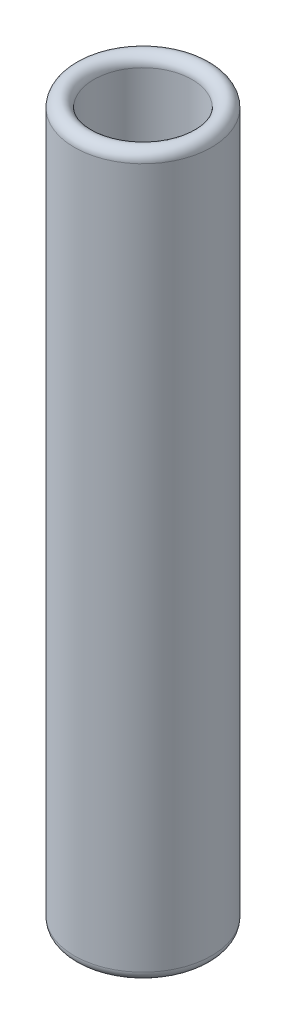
ISO-10303-21;
HEADER;
FILE_DESCRIPTION(('STEP AP214'),'2;1');
FILE_NAME('part.step','',(''),(''),'','','');
FILE_SCHEMA(('AUTOMOTIVE_DESIGN { 1 0 10303 214 1 1 1 1 }'));
ENDSEC;
DATA;
#1=APPLICATION_CONTEXT('core data for automotive mechanical design processes');
#2=APPLICATION_PROTOCOL_DEFINITION('international standard','automotive_design',2000,#1);
#3=PRODUCT_CONTEXT('',#1,'mechanical');
#4=PRODUCT('Part','Part','',(#3));
#5=PRODUCT_RELATED_PRODUCT_CATEGORY('part','',(#4));
#6=PRODUCT_DEFINITION_FORMATION('','',#4);
#7=PRODUCT_DEFINITION_CONTEXT('part definition',#1,'design');
#8=PRODUCT_DEFINITION('design','',#6,#7);
#9=PRODUCT_DEFINITION_SHAPE('','',#8);
#10=(LENGTH_UNIT() NAMED_UNIT(*) SI_UNIT(.MILLI.,.METRE.));
#11=(NAMED_UNIT(*) PLANE_ANGLE_UNIT() SI_UNIT($,.RADIAN.));
#12=(NAMED_UNIT(*) SI_UNIT($,.STERADIAN.) SOLID_ANGLE_UNIT());
#13=UNCERTAINTY_MEASURE_WITH_UNIT(LENGTH_MEASURE(1.E-05),#10,'distance_accuracy_value','');
#14=(GEOMETRIC_REPRESENTATION_CONTEXT(3) GLOBAL_UNCERTAINTY_ASSIGNED_CONTEXT((#13)) GLOBAL_UNIT_ASSIGNED_CONTEXT((#10,
#11,#12)) REPRESENTATION_CONTEXT('',''));
#15=CARTESIAN_POINT('',(0.,0.,0.));
#16=DIRECTION('',(0.,0.,1.));
#17=DIRECTION('',(1.,0.,0.));
#18=AXIS2_PLACEMENT_3D('',#15,#16,#17);
#19=CARTESIAN_POINT('',(0.,0.29,0.));
#20=DIRECTION('',(0.,1.,0.));
#21=DIRECTION('',(0.,0.,1.));
#22=AXIS2_PLACEMENT_3D('',#19,#20,#21);
#23=TOROIDAL_SURFACE('',#22,1.75,0.29);
#24=CARTESIAN_POINT('',(0.,0.289999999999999,0.));
#25=DIRECTION('',(0.,1.,0.));
#26=DIRECTION('',(0.,0.,1.));
#27=AXIS2_PLACEMENT_3D('',#24,#25,#26);
#28=CIRCLE('',#27,2.04);
#29=CARTESIAN_POINT('',(0.,0.289999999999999,2.04));
#30=VERTEX_POINT('',#29);
#31=EDGE_CURVE('E41',#30,#30,#28,.T.);
#32=ORIENTED_EDGE('',*,*,#31,.F.);
#33=EDGE_LOOP('',(#32));
#34=FACE_BOUND('',#33,.T.);
#35=CARTESIAN_POINT('',(0.,0.289999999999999,0.));
#36=DIRECTION('',(0.,1.,0.));
#37=DIRECTION('',(0.,0.,1.));
#38=AXIS2_PLACEMENT_3D('',#35,#36,#37);
#39=CIRCLE('',#38,1.46);
#40=CARTESIAN_POINT('',(0.,0.289999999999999,1.46));
#41=VERTEX_POINT('',#40);
#42=EDGE_CURVE('E10',#41,#41,#39,.F.);
#43=ORIENTED_EDGE('',*,*,#42,.F.);
#44=EDGE_LOOP('',(#43));
#45=FACE_BOUND('',#44,.T.);
#46=ADVANCED_FACE('F34',(#34,#45),#23,.T.);
#47=CARTESIAN_POINT('',(0.,21.11,0.));
#48=DIRECTION('',(0.,1.,0.));
#49=DIRECTION('',(0.,0.,1.));
#50=AXIS2_PLACEMENT_3D('',#47,#48,#49);
#51=TOROIDAL_SURFACE('',#50,1.75,0.289999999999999);
#52=CARTESIAN_POINT('',(0.,21.11,0.));
#53=DIRECTION('',(0.,1.,0.));
#54=DIRECTION('',(0.,0.,1.));
#55=AXIS2_PLACEMENT_3D('',#52,#53,#54);
#56=CIRCLE('',#55,2.04);
#57=CARTESIAN_POINT('',(0.,21.11,2.04));
#58=VERTEX_POINT('',#57);
#59=EDGE_CURVE('E49',#58,#58,#56,.F.);
#60=ORIENTED_EDGE('',*,*,#59,.F.);
#61=EDGE_LOOP('',(#60));
#62=FACE_BOUND('',#61,.T.);
#63=CARTESIAN_POINT('',(0.,21.11,0.));
#64=DIRECTION('',(0.,1.,0.));
#65=DIRECTION('',(0.,0.,1.));
#66=AXIS2_PLACEMENT_3D('',#63,#64,#65);
#67=CIRCLE('',#66,1.46);
#68=CARTESIAN_POINT('',(0.,21.11,1.46));
#69=VERTEX_POINT('',#68);
#70=EDGE_CURVE('E45',#69,#69,#67,.T.);
#71=ORIENTED_EDGE('',*,*,#70,.F.);
#72=EDGE_LOOP('',(#71));
#73=FACE_BOUND('',#72,.T.);
#74=ADVANCED_FACE('F57',(#62,#73),#51,.T.);
#75=CARTESIAN_POINT('',(0.,21.4,0.));
#76=DIRECTION('',(0.,-1.,0.));
#77=DIRECTION('',(0.,0.,-1.));
#78=AXIS2_PLACEMENT_3D('',#75,#76,#77);
#79=CYLINDRICAL_SURFACE('',#78,2.04);
#80=ORIENTED_EDGE('',*,*,#31,.T.);
#81=EDGE_LOOP('',(#80));
#82=FACE_BOUND('',#81,.T.);
#83=ORIENTED_EDGE('',*,*,#59,.T.);
#84=EDGE_LOOP('',(#83));
#85=FACE_BOUND('',#84,.T.);
#86=ADVANCED_FACE('F55',(#82,#85),#79,.T.);
#87=CARTESIAN_POINT('',(0.,21.4,0.));
#88=DIRECTION('',(0.,-1.,0.));
#89=DIRECTION('',(0.,0.,-1.));
#90=AXIS2_PLACEMENT_3D('',#87,#88,#89);
#91=CYLINDRICAL_SURFACE('',#90,1.46);
#92=ORIENTED_EDGE('',*,*,#42,.T.);
#93=EDGE_LOOP('',(#92));
#94=FACE_BOUND('',#93,.T.);
#95=ORIENTED_EDGE('',*,*,#70,.T.);
#96=EDGE_LOOP('',(#95));
#97=FACE_BOUND('',#96,.T.);
#98=ADVANCED_FACE('F62',(#94,#97),#91,.F.);
#99=CLOSED_SHELL('',(#46,#74,#86,#98));
#100=MANIFOLD_SOLID_BREP('B2',#99);
#101=ADVANCED_BREP_SHAPE_REPRESENTATION('',(#18,#100),#14);
#102=SHAPE_DEFINITION_REPRESENTATION(#9,#101);
ENDSEC;
END-ISO-10303-21;
